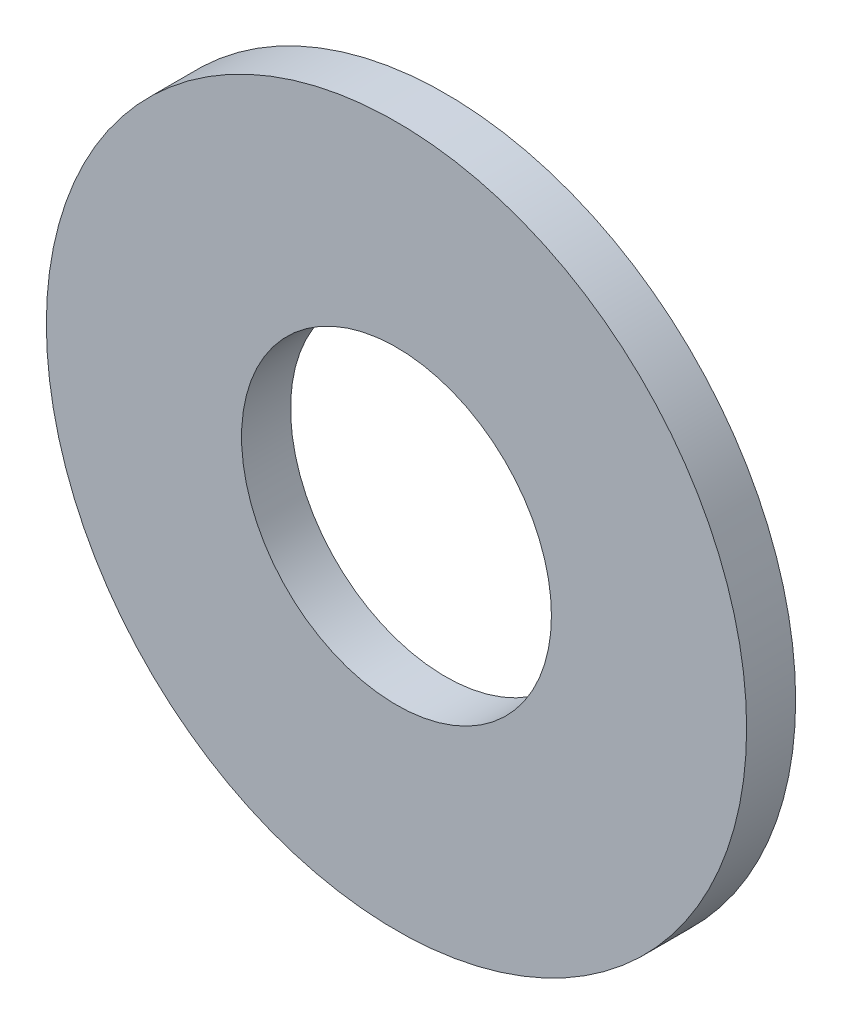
ISO-10303-21;
HEADER;
FILE_DESCRIPTION(('STEP AP214'),'2;1');
FILE_NAME('part.step','',(''),(''),'','','');
FILE_SCHEMA(('AUTOMOTIVE_DESIGN { 1 0 10303 214 1 1 1 1 }'));
ENDSEC;
DATA;
#1=APPLICATION_CONTEXT('core data for automotive mechanical design processes');
#2=APPLICATION_PROTOCOL_DEFINITION('international standard','automotive_design',2000,#1);
#3=PRODUCT_CONTEXT('',#1,'mechanical');
#4=PRODUCT('Part','Part','',(#3));
#5=PRODUCT_RELATED_PRODUCT_CATEGORY('part','',(#4));
#6=PRODUCT_DEFINITION_FORMATION('','',#4);
#7=PRODUCT_DEFINITION_CONTEXT('part definition',#1,'design');
#8=PRODUCT_DEFINITION('design','',#6,#7);
#9=PRODUCT_DEFINITION_SHAPE('','',#8);
#10=(LENGTH_UNIT() NAMED_UNIT(*) SI_UNIT(.MILLI.,.METRE.));
#11=(NAMED_UNIT(*) PLANE_ANGLE_UNIT() SI_UNIT($,.RADIAN.));
#12=(NAMED_UNIT(*) SI_UNIT($,.STERADIAN.) SOLID_ANGLE_UNIT());
#13=UNCERTAINTY_MEASURE_WITH_UNIT(LENGTH_MEASURE(1.E-05),#10,'distance_accuracy_value','');
#14=(GEOMETRIC_REPRESENTATION_CONTEXT(3) GLOBAL_UNCERTAINTY_ASSIGNED_CONTEXT((#13)) GLOBAL_UNIT_ASSIGNED_CONTEXT((#10,
#11,#12)) REPRESENTATION_CONTEXT('',''));
#15=CARTESIAN_POINT('',(0.,0.,0.));
#16=DIRECTION('',(0.,0.,1.));
#17=DIRECTION('',(1.,0.,0.));
#18=AXIS2_PLACEMENT_3D('',#15,#16,#17);
#19=CARTESIAN_POINT('',(0.,0.,1.778));
#20=DIRECTION('',(0.,0.,1.));
#21=DIRECTION('',(1.,0.,0.));
#22=AXIS2_PLACEMENT_3D('',#19,#20,#21);
#23=PLANE('',#22);
#24=CARTESIAN_POINT('',(0.,0.,1.778));
#25=DIRECTION('',(0.,0.,1.));
#26=DIRECTION('',(1.,0.,0.));
#27=AXIS2_PLACEMENT_3D('',#24,#25,#26);
#28=CIRCLE('',#27,12.7);
#29=CARTESIAN_POINT('',(12.7,0.,1.778));
#30=VERTEX_POINT('',#29);
#31=EDGE_CURVE('E10',#30,#30,#28,.T.);
#32=ORIENTED_EDGE('',*,*,#31,.T.);
#33=EDGE_LOOP('',(#32));
#34=FACE_BOUND('',#33,.T.);
#35=CARTESIAN_POINT('',(0.,0.,1.778));
#36=DIRECTION('',(0.,0.,1.));
#37=DIRECTION('',(1.,0.,0.));
#38=AXIS2_PLACEMENT_3D('',#35,#36,#37);
#39=CIRCLE('',#38,5.61975);
#40=CARTESIAN_POINT('',(5.61975,0.,1.778));
#41=VERTEX_POINT('',#40);
#42=EDGE_CURVE('E42',#41,#41,#39,.T.);
#43=ORIENTED_EDGE('',*,*,#42,.F.);
#44=EDGE_LOOP('',(#43));
#45=FACE_BOUND('',#44,.T.);
#46=ADVANCED_FACE('F31',(#34,#45),#23,.T.);
#47=CARTESIAN_POINT('',(0.,0.,0.));
#48=DIRECTION('',(0.,0.,1.));
#49=DIRECTION('',(1.,0.,0.));
#50=AXIS2_PLACEMENT_3D('',#47,#48,#49);
#51=PLANE('',#50);
#52=CARTESIAN_POINT('',(0.,0.,0.));
#53=DIRECTION('',(0.,0.,1.));
#54=DIRECTION('',(1.,0.,0.));
#55=AXIS2_PLACEMENT_3D('',#52,#53,#54);
#56=CIRCLE('',#55,12.7);
#57=CARTESIAN_POINT('',(12.7,0.,0.));
#58=VERTEX_POINT('',#57);
#59=EDGE_CURVE('E35',#58,#58,#56,.T.);
#60=ORIENTED_EDGE('',*,*,#59,.F.);
#61=EDGE_LOOP('',(#60));
#62=FACE_BOUND('',#61,.T.);
#63=CARTESIAN_POINT('',(0.,0.,0.));
#64=DIRECTION('',(0.,0.,1.));
#65=DIRECTION('',(1.,0.,0.));
#66=AXIS2_PLACEMENT_3D('',#63,#64,#65);
#67=CIRCLE('',#66,5.61975);
#68=CARTESIAN_POINT('',(5.61975,0.,0.));
#69=VERTEX_POINT('',#68);
#70=EDGE_CURVE('E44',#69,#69,#67,.T.);
#71=ORIENTED_EDGE('',*,*,#70,.T.);
#72=EDGE_LOOP('',(#71));
#73=FACE_BOUND('',#72,.T.);
#74=ADVANCED_FACE('F54',(#62,#73),#51,.F.);
#75=CARTESIAN_POINT('',(0.,0.,1.778));
#76=DIRECTION('',(0.,0.,-1.));
#77=DIRECTION('',(-1.,0.,0.));
#78=AXIS2_PLACEMENT_3D('',#75,#76,#77);
#79=CYLINDRICAL_SURFACE('',#78,12.7);
#80=ORIENTED_EDGE('',*,*,#31,.F.);
#81=EDGE_LOOP('',(#80));
#82=FACE_BOUND('',#81,.T.);
#83=ORIENTED_EDGE('',*,*,#59,.T.);
#84=EDGE_LOOP('',(#83));
#85=FACE_BOUND('',#84,.T.);
#86=ADVANCED_FACE('F33',(#82,#85),#79,.T.);
#87=CARTESIAN_POINT('',(0.,0.,1.778));
#88=DIRECTION('',(0.,0.,-1.));
#89=DIRECTION('',(-1.,0.,0.));
#90=AXIS2_PLACEMENT_3D('',#87,#88,#89);
#91=CYLINDRICAL_SURFACE('',#90,5.61975);
#92=ORIENTED_EDGE('',*,*,#42,.T.);
#93=EDGE_LOOP('',(#92));
#94=FACE_BOUND('',#93,.T.);
#95=ORIENTED_EDGE('',*,*,#70,.F.);
#96=EDGE_LOOP('',(#95));
#97=FACE_BOUND('',#96,.T.);
#98=ADVANCED_FACE('F50',(#94,#97),#91,.F.);
#99=CLOSED_SHELL('',(#46,#74,#86,#98));
#100=MANIFOLD_SOLID_BREP('B2',#99);
#101=ADVANCED_BREP_SHAPE_REPRESENTATION('',(#18,#100),#14);
#102=SHAPE_DEFINITION_REPRESENTATION(#9,#101);
ENDSEC;
END-ISO-10303-21;
